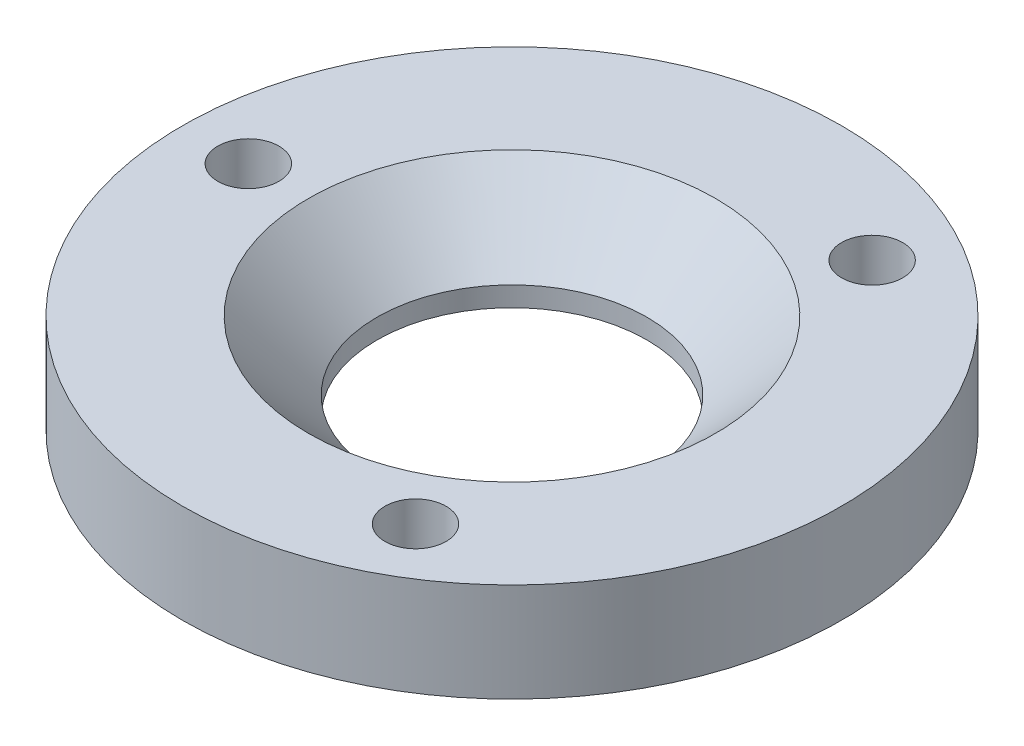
from build123d import *

# Parameters (mm, degrees)
F_32_0_116_DIAMETER_HOLE1_D = 2.9464
CIRPATTERN1_COUNT           = 3
CHAMFER1_SIZE               = 3.302


with BuildPart() as part:
    # Sketch1 → Revolve1 (revolve)
    with BuildSketch(Plane(origin=(0, 0, 0), x_dir=(0, 0, -1), z_dir=(1, 0, 0)), mode=Mode.PRIVATE) as revolve1_sk:
        Polygon((6.5024, -4.2545), (10.16, -4.2545), (10.16, -4.7625), (15.875, -4.7625), (15.875, 0), (6.5024, 0), align=None)
    revolve(revolve1_sk.sketch.rotate(Axis((0, 0, 0), (0, -1, 0)), 180), axis=Axis((0, 0, 0), (0, -1, 0)))

    # 32 _0.116_ Diameter Hole1 (through all)
    with Locations(Plane(origin=(0, 0, 0), x_dir=(-1, 0, 0), z_dir=(0, 1, 0))):
        with Locations((12.7, 0)):
            f_32_0_116_diameter_hole1 = Hole(F_32_0_116_DIAMETER_HOLE1_D / 2)

    # CirPattern1: 32 _0.116_ Diameter Hole1 ×3 about axis
    cirpattern1_axis = Axis((0, 0, 0), (0, 1, 0))
    for i in range(1, CIRPATTERN1_COUNT):
        add(f_32_0_116_diameter_hole1.rotate(cirpattern1_axis, i * 360 / CIRPATTERN1_COUNT), mode=Mode.SUBTRACT)

    # Chamfer1
    chamfer1_edges = [part.edges().sort_by_distance(p)[0] for p in [
        (0, 0, -6.5024),
    ]]
    chamfer(chamfer1_edges, length=CHAMFER1_SIZE)


solid = part.part
